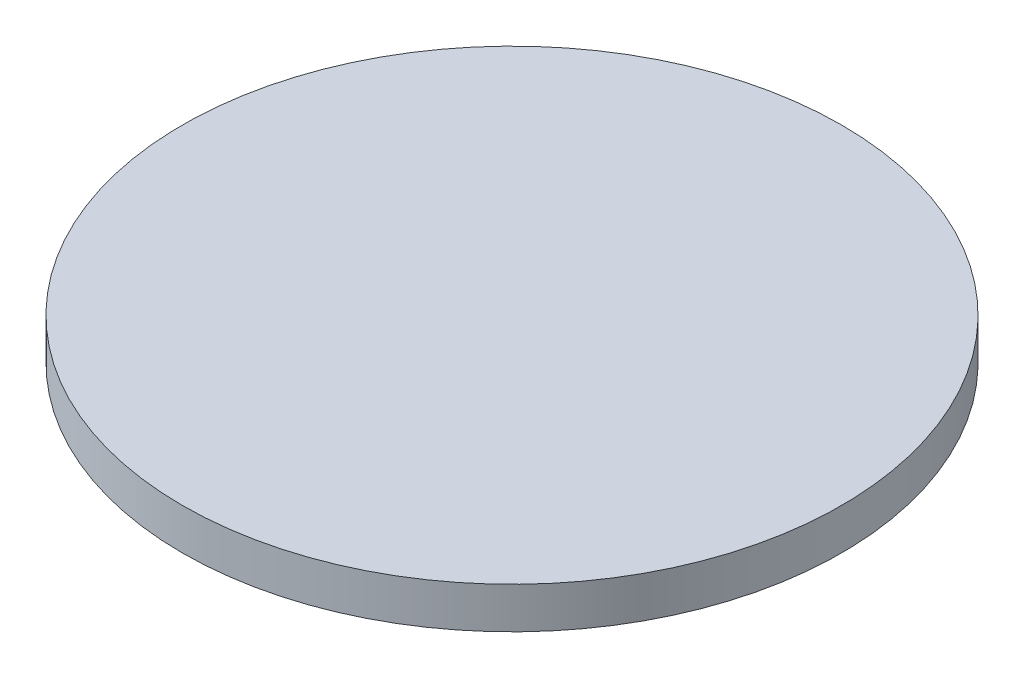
from build123d import *

# Parameters (mm, degrees)
SKETCH1_R           = 50.8
BOSS_EXTRUDE1_DEPTH = 6.35


with BuildPart() as part:
    # Sketch1 → Boss-Extrude1 (new body)
    with BuildSketch(Plane(origin=(0, 0, 0), x_dir=(1, 0, 0), z_dir=(0, 1, 0))):
        with Locations(Location((0, 0, 0), (0, 0, 270))):
            Circle(SKETCH1_R)
    extrude(amount=BOSS_EXTRUDE1_DEPTH)


solid = part.part
